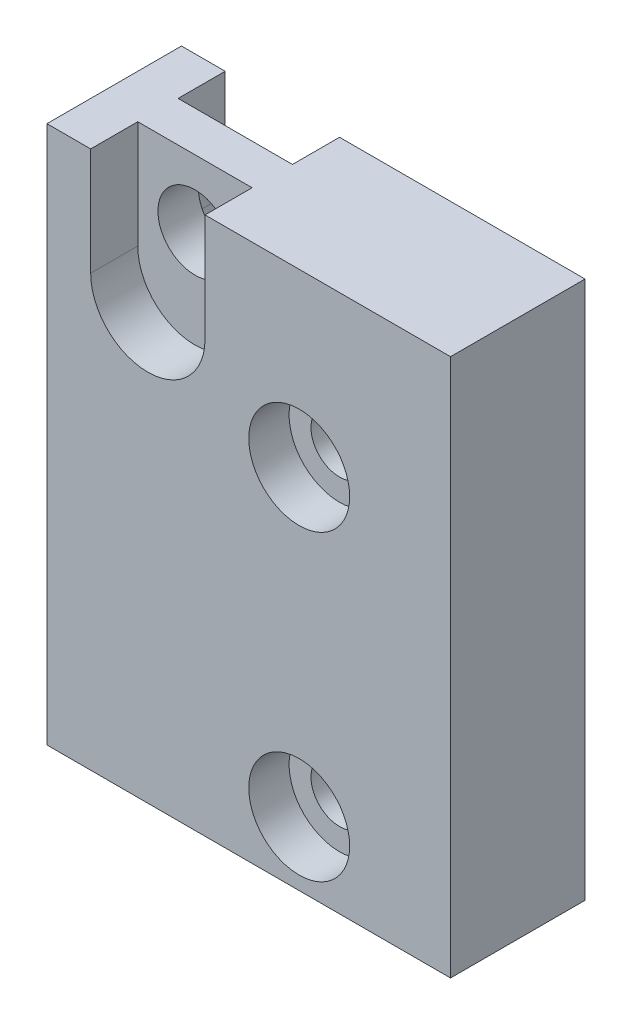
ISO-10303-21;
HEADER;
FILE_DESCRIPTION(('STEP AP214'),'2;1');
FILE_NAME('part.step','',(''),(''),'','','');
FILE_SCHEMA(('AUTOMOTIVE_DESIGN { 1 0 10303 214 1 1 1 1 }'));
ENDSEC;
DATA;
#1=APPLICATION_CONTEXT('core data for automotive mechanical design processes');
#2=APPLICATION_PROTOCOL_DEFINITION('international standard','automotive_design',2000,#1);
#3=PRODUCT_CONTEXT('',#1,'mechanical');
#4=PRODUCT('Part','Part','',(#3));
#5=PRODUCT_RELATED_PRODUCT_CATEGORY('part','',(#4));
#6=PRODUCT_DEFINITION_FORMATION('','',#4);
#7=PRODUCT_DEFINITION_CONTEXT('part definition',#1,'design');
#8=PRODUCT_DEFINITION('design','',#6,#7);
#9=PRODUCT_DEFINITION_SHAPE('','',#8);
#10=(LENGTH_UNIT() NAMED_UNIT(*) SI_UNIT(.MILLI.,.METRE.));
#11=(NAMED_UNIT(*) PLANE_ANGLE_UNIT() SI_UNIT($,.RADIAN.));
#12=(NAMED_UNIT(*) SI_UNIT($,.STERADIAN.) SOLID_ANGLE_UNIT());
#13=UNCERTAINTY_MEASURE_WITH_UNIT(LENGTH_MEASURE(1.E-05),#10,'distance_accuracy_value','');
#14=(GEOMETRIC_REPRESENTATION_CONTEXT(3) GLOBAL_UNCERTAINTY_ASSIGNED_CONTEXT((#13)) GLOBAL_UNIT_ASSIGNED_CONTEXT((#10,
#11,#12)) REPRESENTATION_CONTEXT('',''));
#15=CARTESIAN_POINT('',(0.,0.,0.));
#16=DIRECTION('',(0.,0.,1.));
#17=DIRECTION('',(1.,0.,0.));
#18=AXIS2_PLACEMENT_3D('',#15,#16,#17);
#19=CARTESIAN_POINT('',(0.,0.,-10.));
#20=DIRECTION('',(0.,0.,1.));
#21=DIRECTION('',(1.,0.,0.));
#22=AXIS2_PLACEMENT_3D('',#19,#20,#21);
#23=PLANE('',#22);
#24=CARTESIAN_POINT('',(7.5,14.5,-10.));
#25=DIRECTION('',(0.,0.,1.));
#26=DIRECTION('',(1.,0.,0.));
#27=AXIS2_PLACEMENT_3D('',#24,#25,#26);
#28=CIRCLE('',#27,7.5);
#29=CARTESIAN_POINT('',(0.,14.5,-10.));
#30=VERTEX_POINT('',#29);
#31=EDGE_CURVE('E158',#30,#30,#28,.T.);
#32=ORIENTED_EDGE('',*,*,#31,.T.);
#33=EDGE_LOOP('',(#32));
#34=FACE_BOUND('',#33,.T.);
#35=CARTESIAN_POINT('',(7.5,-30.5,-10.));
#36=DIRECTION('',(0.,0.,1.));
#37=DIRECTION('',(1.,0.,0.));
#38=AXIS2_PLACEMENT_3D('',#35,#36,#37);
#39=CIRCLE('',#38,7.5);
#40=CARTESIAN_POINT('',(0.,-30.5,-10.));
#41=VERTEX_POINT('',#40);
#42=EDGE_CURVE('E161',#41,#41,#39,.T.);
#43=ORIENTED_EDGE('',*,*,#42,.T.);
#44=EDGE_LOOP('',(#43));
#45=FACE_BOUND('',#44,.T.);
#46=DIRECTION('',(0.,-1.,0.));
#47=VECTOR('',#46,1.);
#48=CARTESIAN_POINT('',(-23.5,0.,-10.));
#49=LINE('',#48,#47);
#50=CARTESIAN_POINT('',(-23.5,40.,-10.));
#51=VERTEX_POINT('',#50);
#52=CARTESIAN_POINT('',(-23.5,24.,-10.));
#53=VERTEX_POINT('',#52);
#54=EDGE_CURVE('E509',#51,#53,#49,.T.);
#55=ORIENTED_EDGE('',*,*,#54,.T.);
#56=CARTESIAN_POINT('',(-15.,24.,-10.));
#57=DIRECTION('',(0.,0.,1.));
#58=DIRECTION('',(1.,0.,0.));
#59=AXIS2_PLACEMENT_3D('',#56,#57,#58);
#60=CIRCLE('',#59,8.5);
#61=CARTESIAN_POINT('',(-6.5,24.,-10.));
#62=VERTEX_POINT('',#61);
#63=EDGE_CURVE('E501',#53,#62,#60,.T.);
#64=ORIENTED_EDGE('',*,*,#63,.T.);
#65=DIRECTION('',(0.,1.,0.));
#66=VECTOR('',#65,1.);
#67=CARTESIAN_POINT('',(-6.5,0.,-10.));
#68=LINE('',#67,#66);
#69=CARTESIAN_POINT('',(-6.50000000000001,40.,-10.));
#70=VERTEX_POINT('',#69);
#71=EDGE_CURVE('E505',#62,#70,#68,.T.);
#72=ORIENTED_EDGE('',*,*,#71,.T.);
#73=DIRECTION('',(1.,0.,0.));
#74=VECTOR('',#73,1.);
#75=CARTESIAN_POINT('',(0.,40.,-10.));
#76=LINE('',#75,#74);
#77=CARTESIAN_POINT('',(30.,40.,-10.));
#78=VERTEX_POINT('',#77);
#79=EDGE_CURVE('E146',#70,#78,#76,.T.);
#80=ORIENTED_EDGE('',*,*,#79,.T.);
#81=DIRECTION('',(0.,-1.,0.));
#82=VECTOR('',#81,1.);
#83=CARTESIAN_POINT('',(30.,0.,-10.));
#84=LINE('',#83,#82);
#85=CARTESIAN_POINT('',(30.,-40.,-10.));
#86=VERTEX_POINT('',#85);
#87=EDGE_CURVE('E238',#78,#86,#84,.T.);
#88=ORIENTED_EDGE('',*,*,#87,.T.);
#89=DIRECTION('',(-1.,0.,0.));
#90=VECTOR('',#89,1.);
#91=CARTESIAN_POINT('',(0.,-40.,-10.));
#92=LINE('',#91,#90);
#93=CARTESIAN_POINT('',(-30.,-40.,-10.));
#94=VERTEX_POINT('',#93);
#95=EDGE_CURVE('E236',#86,#94,#92,.T.);
#96=ORIENTED_EDGE('',*,*,#95,.T.);
#97=DIRECTION('',(0.,1.,0.));
#98=VECTOR('',#97,1.);
#99=CARTESIAN_POINT('',(-30.,0.,-10.));
#100=LINE('',#99,#98);
#101=CARTESIAN_POINT('',(-30.,40.,-10.));
#102=VERTEX_POINT('',#101);
#103=EDGE_CURVE('E233',#94,#102,#100,.T.);
#104=ORIENTED_EDGE('',*,*,#103,.T.);
#105=EDGE_CURVE('E240',#102,#51,#76,.T.);
#106=ORIENTED_EDGE('',*,*,#105,.T.);
#107=EDGE_LOOP('',(#55,#64,#72,#80,#88,#96,#104,#106));
#108=FACE_BOUND('',#107,.T.);
#109=ADVANCED_FACE('F37',(#34,#45,#108),#23,.F.);
#110=CARTESIAN_POINT('',(-15.,30.,-10.));
#111=DIRECTION('',(0.,0.,1.));
#112=DIRECTION('',(1.,0.,0.));
#113=AXIS2_PLACEMENT_3D('',#110,#111,#112);
#114=CYLINDRICAL_SURFACE('',#113,5.5);
#115=CARTESIAN_POINT('',(-15.,30.,3.));
#116=DIRECTION('',(0.,0.,1.));
#117=DIRECTION('',(1.,0.,0.));
#118=AXIS2_PLACEMENT_3D('',#115,#116,#117);
#119=CIRCLE('',#118,5.5);
#120=CARTESIAN_POINT('',(-9.50000000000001,30.,3.));
#121=VERTEX_POINT('',#120);
#122=EDGE_CURVE('E172',#121,#121,#119,.F.);
#123=ORIENTED_EDGE('',*,*,#122,.F.);
#124=EDGE_LOOP('',(#123));
#125=FACE_BOUND('',#124,.T.);
#126=CARTESIAN_POINT('',(-15.,30.,-3.));
#127=DIRECTION('',(0.,0.,1.));
#128=DIRECTION('',(1.,0.,0.));
#129=AXIS2_PLACEMENT_3D('',#126,#127,#128);
#130=CIRCLE('',#129,5.5);
#131=CARTESIAN_POINT('',(-9.50000000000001,30.,-3.));
#132=VERTEX_POINT('',#131);
#133=EDGE_CURVE('E499',#132,#132,#130,.F.);
#134=ORIENTED_EDGE('',*,*,#133,.T.);
#135=EDGE_LOOP('',(#134));
#136=FACE_BOUND('',#135,.T.);
#137=ADVANCED_FACE('F39',(#125,#136),#114,.F.);
#138=CARTESIAN_POINT('',(0.,40.,-10.));
#139=DIRECTION('',(0.,-1.,0.));
#140=DIRECTION('',(0.,0.,-1.));
#141=AXIS2_PLACEMENT_3D('',#138,#139,#140);
#142=PLANE('',#141);
#143=DIRECTION('',(0.,0.,-1.));
#144=VECTOR('',#143,1.);
#145=CARTESIAN_POINT('',(-23.5,40.,-3.));
#146=LINE('',#145,#144);
#147=CARTESIAN_POINT('',(-23.5,40.,-3.));
#148=VERTEX_POINT('',#147);
#149=EDGE_CURVE('E147',#148,#51,#146,.T.);
#150=ORIENTED_EDGE('',*,*,#149,.T.);
#151=ORIENTED_EDGE('',*,*,#105,.F.);
#152=DIRECTION('',(0.,0.,1.));
#153=VECTOR('',#152,1.);
#154=CARTESIAN_POINT('',(-30.,40.,-10.));
#155=LINE('',#154,#153);
#156=CARTESIAN_POINT('',(-30.,40.,10.));
#157=VERTEX_POINT('',#156);
#158=EDGE_CURVE('E11',#102,#157,#155,.T.);
#159=ORIENTED_EDGE('',*,*,#158,.T.);
#160=DIRECTION('',(1.,0.,0.));
#161=VECTOR('',#160,1.);
#162=CARTESIAN_POINT('',(0.,40.,10.));
#163=LINE('',#162,#161);
#164=CARTESIAN_POINT('',(-23.5,40.,10.));
#165=VERTEX_POINT('',#164);
#166=EDGE_CURVE('E230',#157,#165,#163,.T.);
#167=ORIENTED_EDGE('',*,*,#166,.T.);
#168=DIRECTION('',(0.,0.,1.));
#169=VECTOR('',#168,1.);
#170=CARTESIAN_POINT('',(-23.5,40.,3.));
#171=LINE('',#170,#169);
#172=CARTESIAN_POINT('',(-23.5,40.,3.));
#173=VERTEX_POINT('',#172);
#174=EDGE_CURVE('E194',#173,#165,#171,.T.);
#175=ORIENTED_EDGE('',*,*,#174,.F.);
#176=DIRECTION('',(-1.,0.,0.));
#177=VECTOR('',#176,1.);
#178=CARTESIAN_POINT('',(0.,40.,3.));
#179=LINE('',#178,#177);
#180=CARTESIAN_POINT('',(-6.50000000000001,40.,3.));
#181=VERTEX_POINT('',#180);
#182=EDGE_CURVE('E185',#181,#173,#179,.T.);
#183=ORIENTED_EDGE('',*,*,#182,.F.);
#184=DIRECTION('',(0.,0.,1.));
#185=VECTOR('',#184,1.);
#186=CARTESIAN_POINT('',(-6.50000000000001,40.,3.));
#187=LINE('',#186,#185);
#188=CARTESIAN_POINT('',(-6.50000000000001,40.,10.));
#189=VERTEX_POINT('',#188);
#190=EDGE_CURVE('E197',#181,#189,#187,.T.);
#191=ORIENTED_EDGE('',*,*,#190,.T.);
#192=CARTESIAN_POINT('',(30.,40.,10.));
#193=VERTEX_POINT('',#192);
#194=EDGE_CURVE('E229',#189,#193,#163,.T.);
#195=ORIENTED_EDGE('',*,*,#194,.T.);
#196=DIRECTION('',(0.,0.,1.));
#197=VECTOR('',#196,1.);
#198=CARTESIAN_POINT('',(30.,40.,-10.));
#199=LINE('',#198,#197);
#200=EDGE_CURVE('E46',#78,#193,#199,.T.);
#201=ORIENTED_EDGE('',*,*,#200,.F.);
#202=ORIENTED_EDGE('',*,*,#79,.F.);
#203=DIRECTION('',(0.,0.,-1.));
#204=VECTOR('',#203,1.);
#205=CARTESIAN_POINT('',(-6.50000000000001,40.,-3.));
#206=LINE('',#205,#204);
#207=CARTESIAN_POINT('',(-6.50000000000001,40.,-3.));
#208=VERTEX_POINT('',#207);
#209=EDGE_CURVE('E132',#208,#70,#206,.T.);
#210=ORIENTED_EDGE('',*,*,#209,.F.);
#211=DIRECTION('',(-1.,0.,0.));
#212=VECTOR('',#211,1.);
#213=CARTESIAN_POINT('',(0.,40.,-3.));
#214=LINE('',#213,#212);
#215=EDGE_CURVE('E136',#208,#148,#214,.T.);
#216=ORIENTED_EDGE('',*,*,#215,.T.);
#217=EDGE_LOOP('',(#150,#151,#159,#167,#175,#183,#191,#195,#201,#202,#210,#216));
#218=FACE_BOUND('',#217,.T.);
#219=ADVANCED_FACE('F144',(#218),#142,.F.);
#220=CARTESIAN_POINT('',(7.5,14.5,-10.));
#221=DIRECTION('',(0.,0.,1.));
#222=DIRECTION('',(1.,0.,0.));
#223=AXIS2_PLACEMENT_3D('',#220,#221,#222);
#224=CYLINDRICAL_SURFACE('',#223,4.25);
#225=CARTESIAN_POINT('',(7.5,14.5,4.));
#226=DIRECTION('',(0.,0.,1.));
#227=DIRECTION('',(1.,0.,0.));
#228=AXIS2_PLACEMENT_3D('',#225,#226,#227);
#229=CIRCLE('',#228,4.25);
#230=CARTESIAN_POINT('',(11.75,14.5,4.));
#231=VERTEX_POINT('',#230);
#232=EDGE_CURVE('E203',#231,#231,#229,.F.);
#233=ORIENTED_EDGE('',*,*,#232,.F.);
#234=EDGE_LOOP('',(#233));
#235=FACE_BOUND('',#234,.T.);
#236=CARTESIAN_POINT('',(7.5,14.5,-4.));
#237=DIRECTION('',(0.,0.,1.));
#238=DIRECTION('',(1.,0.,0.));
#239=AXIS2_PLACEMENT_3D('',#236,#237,#238);
#240=CIRCLE('',#239,4.25);
#241=CARTESIAN_POINT('',(11.75,14.5,-4.));
#242=VERTEX_POINT('',#241);
#243=EDGE_CURVE('E154',#242,#242,#240,.F.);
#244=ORIENTED_EDGE('',*,*,#243,.T.);
#245=EDGE_LOOP('',(#244));
#246=FACE_BOUND('',#245,.T.);
#247=ADVANCED_FACE('F284',(#235,#246),#224,.F.);
#248=CARTESIAN_POINT('',(7.5,-30.5,-10.));
#249=DIRECTION('',(0.,0.,1.));
#250=DIRECTION('',(1.,0.,0.));
#251=AXIS2_PLACEMENT_3D('',#248,#249,#250);
#252=CYLINDRICAL_SURFACE('',#251,4.25);
#253=CARTESIAN_POINT('',(7.5,-30.5,4.));
#254=DIRECTION('',(0.,0.,1.));
#255=DIRECTION('',(1.,0.,0.));
#256=AXIS2_PLACEMENT_3D('',#253,#254,#255);
#257=CIRCLE('',#256,4.25);
#258=CARTESIAN_POINT('',(11.75,-30.5,4.));
#259=VERTEX_POINT('',#258);
#260=EDGE_CURVE('E212',#259,#259,#257,.F.);
#261=ORIENTED_EDGE('',*,*,#260,.F.);
#262=EDGE_LOOP('',(#261));
#263=FACE_BOUND('',#262,.T.);
#264=CARTESIAN_POINT('',(7.5,-30.5,-4.));
#265=DIRECTION('',(0.,0.,1.));
#266=DIRECTION('',(1.,0.,0.));
#267=AXIS2_PLACEMENT_3D('',#264,#265,#266);
#268=CIRCLE('',#267,4.25);
#269=CARTESIAN_POINT('',(11.75,-30.5,-4.));
#270=VERTEX_POINT('',#269);
#271=EDGE_CURVE('E164',#270,#270,#268,.F.);
#272=ORIENTED_EDGE('',*,*,#271,.T.);
#273=EDGE_LOOP('',(#272));
#274=FACE_BOUND('',#273,.T.);
#275=ADVANCED_FACE('F288',(#263,#274),#252,.F.);
#276=CARTESIAN_POINT('',(-30.,0.,-10.));
#277=DIRECTION('',(1.,0.,0.));
#278=DIRECTION('',(0.,0.,-1.));
#279=AXIS2_PLACEMENT_3D('',#276,#277,#278);
#280=PLANE('',#279);
#281=DIRECTION('',(0.,0.,1.));
#282=VECTOR('',#281,1.);
#283=CARTESIAN_POINT('',(-30.,-40.,-10.));
#284=LINE('',#283,#282);
#285=CARTESIAN_POINT('',(-30.,-40.,10.));
#286=VERTEX_POINT('',#285);
#287=EDGE_CURVE('E41',#94,#286,#284,.T.);
#288=ORIENTED_EDGE('',*,*,#287,.T.);
#289=DIRECTION('',(0.,1.,0.));
#290=VECTOR('',#289,1.);
#291=CARTESIAN_POINT('',(-30.,0.,10.));
#292=LINE('',#291,#290);
#293=EDGE_CURVE('E218',#286,#157,#292,.T.);
#294=ORIENTED_EDGE('',*,*,#293,.T.);
#295=ORIENTED_EDGE('',*,*,#158,.F.);
#296=ORIENTED_EDGE('',*,*,#103,.F.);
#297=EDGE_LOOP('',(#288,#294,#295,#296));
#298=FACE_BOUND('',#297,.T.);
#299=ADVANCED_FACE('F253',(#298),#280,.F.);
#300=CARTESIAN_POINT('',(30.,0.,-10.));
#301=DIRECTION('',(-1.,0.,0.));
#302=DIRECTION('',(0.,0.,1.));
#303=AXIS2_PLACEMENT_3D('',#300,#301,#302);
#304=PLANE('',#303);
#305=ORIENTED_EDGE('',*,*,#200,.T.);
#306=DIRECTION('',(0.,-1.,0.));
#307=VECTOR('',#306,1.);
#308=CARTESIAN_POINT('',(30.,0.,10.));
#309=LINE('',#308,#307);
#310=CARTESIAN_POINT('',(30.,-40.,10.));
#311=VERTEX_POINT('',#310);
#312=EDGE_CURVE('E226',#193,#311,#309,.T.);
#313=ORIENTED_EDGE('',*,*,#312,.T.);
#314=DIRECTION('',(0.,0.,1.));
#315=VECTOR('',#314,1.);
#316=CARTESIAN_POINT('',(30.,-40.,-10.));
#317=LINE('',#316,#315);
#318=EDGE_CURVE('E244',#86,#311,#317,.T.);
#319=ORIENTED_EDGE('',*,*,#318,.F.);
#320=ORIENTED_EDGE('',*,*,#87,.F.);
#321=EDGE_LOOP('',(#305,#313,#319,#320));
#322=FACE_BOUND('',#321,.T.);
#323=ADVANCED_FACE('F262',(#322),#304,.F.);
#324=CARTESIAN_POINT('',(0.,-40.,-10.));
#325=DIRECTION('',(0.,1.,0.));
#326=DIRECTION('',(0.,0.,1.));
#327=AXIS2_PLACEMENT_3D('',#324,#325,#326);
#328=PLANE('',#327);
#329=ORIENTED_EDGE('',*,*,#318,.T.);
#330=DIRECTION('',(-1.,0.,0.));
#331=VECTOR('',#330,1.);
#332=CARTESIAN_POINT('',(0.,-40.,10.));
#333=LINE('',#332,#331);
#334=EDGE_CURVE('E223',#311,#286,#333,.T.);
#335=ORIENTED_EDGE('',*,*,#334,.T.);
#336=ORIENTED_EDGE('',*,*,#287,.F.);
#337=ORIENTED_EDGE('',*,*,#95,.F.);
#338=EDGE_LOOP('',(#329,#335,#336,#337));
#339=FACE_BOUND('',#338,.T.);
#340=ADVANCED_FACE('F260',(#339),#328,.F.);
#341=CARTESIAN_POINT('',(0.,0.,10.));
#342=DIRECTION('',(0.,0.,1.));
#343=DIRECTION('',(1.,0.,0.));
#344=AXIS2_PLACEMENT_3D('',#341,#342,#343);
#345=PLANE('',#344);
#346=DIRECTION('',(0.,-1.,0.));
#347=VECTOR('',#346,1.);
#348=CARTESIAN_POINT('',(-23.5,0.,10.));
#349=LINE('',#348,#347);
#350=CARTESIAN_POINT('',(-23.5,24.,10.));
#351=VERTEX_POINT('',#350);
#352=EDGE_CURVE('E62',#165,#351,#349,.T.);
#353=ORIENTED_EDGE('',*,*,#352,.F.);
#354=ORIENTED_EDGE('',*,*,#166,.F.);
#355=ORIENTED_EDGE('',*,*,#293,.F.);
#356=ORIENTED_EDGE('',*,*,#334,.F.);
#357=ORIENTED_EDGE('',*,*,#312,.F.);
#358=ORIENTED_EDGE('',*,*,#194,.F.);
#359=DIRECTION('',(0.,1.,0.));
#360=VECTOR('',#359,1.);
#361=CARTESIAN_POINT('',(-6.5,0.,10.));
#362=LINE('',#361,#360);
#363=CARTESIAN_POINT('',(-6.5,24.,10.));
#364=VERTEX_POINT('',#363);
#365=EDGE_CURVE('E176',#364,#189,#362,.T.);
#366=ORIENTED_EDGE('',*,*,#365,.F.);
#367=CARTESIAN_POINT('',(-15.,24.,10.));
#368=DIRECTION('',(0.,0.,1.));
#369=DIRECTION('',(1.,0.,0.));
#370=AXIS2_PLACEMENT_3D('',#367,#368,#369);
#371=CIRCLE('',#370,8.5);
#372=EDGE_CURVE('E190',#351,#364,#371,.T.);
#373=ORIENTED_EDGE('',*,*,#372,.F.);
#374=EDGE_LOOP('',(#353,#354,#355,#356,#357,#358,#366,#373));
#375=FACE_BOUND('',#374,.T.);
#376=CARTESIAN_POINT('',(7.5,14.5,10.));
#377=DIRECTION('',(0.,0.,1.));
#378=DIRECTION('',(1.,0.,0.));
#379=AXIS2_PLACEMENT_3D('',#376,#377,#378);
#380=CIRCLE('',#379,7.5);
#381=CARTESIAN_POINT('',(15.,14.5,10.));
#382=VERTEX_POINT('',#381);
#383=EDGE_CURVE('E196',#382,#382,#380,.T.);
#384=ORIENTED_EDGE('',*,*,#383,.F.);
#385=EDGE_LOOP('',(#384));
#386=FACE_BOUND('',#385,.T.);
#387=CARTESIAN_POINT('',(7.5,-30.5,10.));
#388=DIRECTION('',(0.,0.,1.));
#389=DIRECTION('',(1.,0.,0.));
#390=AXIS2_PLACEMENT_3D('',#387,#388,#389);
#391=CIRCLE('',#390,7.5);
#392=CARTESIAN_POINT('',(15.,-30.5,10.));
#393=VERTEX_POINT('',#392);
#394=EDGE_CURVE('E209',#393,#393,#391,.T.);
#395=ORIENTED_EDGE('',*,*,#394,.F.);
#396=EDGE_LOOP('',(#395));
#397=FACE_BOUND('',#396,.T.);
#398=ADVANCED_FACE('F257',(#375,#386,#397),#345,.T.);
#399=CARTESIAN_POINT('',(7.5,-30.5,4.));
#400=DIRECTION('',(0.,0.,1.));
#401=DIRECTION('',(1.,0.,0.));
#402=AXIS2_PLACEMENT_3D('',#399,#400,#401);
#403=CYLINDRICAL_SURFACE('',#402,7.5);
#404=CARTESIAN_POINT('',(7.5,-30.5,4.));
#405=DIRECTION('',(0.,0.,1.));
#406=DIRECTION('',(1.,0.,0.));
#407=AXIS2_PLACEMENT_3D('',#404,#405,#406);
#408=CIRCLE('',#407,7.5);
#409=CARTESIAN_POINT('',(15.,-30.5,4.));
#410=VERTEX_POINT('',#409);
#411=EDGE_CURVE('E215',#410,#410,#408,.T.);
#412=CARTESIAN_POINT('',(15.,-30.5,4.));
#413=CARTESIAN_POINT('',(15.,-30.5,4.0625));
#414=CARTESIAN_POINT('',(15.,-30.5,4.125));
#415=CARTESIAN_POINT('',(15.,-30.5,4.25));
#416=CARTESIAN_POINT('',(15.,-30.5,4.3125));
#417=CARTESIAN_POINT('',(15.,-30.5,4.4375));
#418=CARTESIAN_POINT('',(15.,-30.5,4.5));
#419=CARTESIAN_POINT('',(15.,-30.5,4.625));
#420=CARTESIAN_POINT('',(15.,-30.5,4.6875));
#421=CARTESIAN_POINT('',(15.,-30.5,4.8125));
#422=CARTESIAN_POINT('',(15.,-30.5,4.875));
#423=CARTESIAN_POINT('',(15.,-30.5,5.));
#424=CARTESIAN_POINT('',(15.,-30.5,5.0625));
#425=CARTESIAN_POINT('',(15.,-30.5,5.1875));
#426=CARTESIAN_POINT('',(15.,-30.5,5.25));
#427=CARTESIAN_POINT('',(15.,-30.5,5.375));
#428=CARTESIAN_POINT('',(15.,-30.5,5.4375));
#429=CARTESIAN_POINT('',(15.,-30.5,5.5625));
#430=CARTESIAN_POINT('',(15.,-30.5,5.625));
#431=CARTESIAN_POINT('',(15.,-30.5,5.75));
#432=CARTESIAN_POINT('',(15.,-30.5,5.8125));
#433=CARTESIAN_POINT('',(15.,-30.5,5.9375));
#434=CARTESIAN_POINT('',(15.,-30.5,6.));
#435=CARTESIAN_POINT('',(15.,-30.5,6.125));
#436=CARTESIAN_POINT('',(15.,-30.5,6.1875));
#437=CARTESIAN_POINT('',(15.,-30.5,6.3125));
#438=CARTESIAN_POINT('',(15.,-30.5,6.375));
#439=CARTESIAN_POINT('',(15.,-30.5,6.5));
#440=CARTESIAN_POINT('',(15.,-30.5,6.5625));
#441=CARTESIAN_POINT('',(15.,-30.5,6.6875));
#442=CARTESIAN_POINT('',(15.,-30.5,6.75));
#443=CARTESIAN_POINT('',(15.,-30.5,6.875));
#444=CARTESIAN_POINT('',(15.,-30.5,6.9375));
#445=CARTESIAN_POINT('',(15.,-30.5,7.0625));
#446=CARTESIAN_POINT('',(15.,-30.5,7.125));
#447=CARTESIAN_POINT('',(15.,-30.5,7.25));
#448=CARTESIAN_POINT('',(15.,-30.5,7.3125));
#449=CARTESIAN_POINT('',(15.,-30.5,7.4375));
#450=CARTESIAN_POINT('',(15.,-30.5,7.5));
#451=CARTESIAN_POINT('',(15.,-30.5,7.625));
#452=CARTESIAN_POINT('',(15.,-30.5,7.6875));
#453=CARTESIAN_POINT('',(15.,-30.5,7.8125));
#454=CARTESIAN_POINT('',(15.,-30.5,7.875));
#455=CARTESIAN_POINT('',(15.,-30.5,8.));
#456=CARTESIAN_POINT('',(15.,-30.5,8.0625));
#457=CARTESIAN_POINT('',(15.,-30.5,8.1875));
#458=CARTESIAN_POINT('',(15.,-30.5,8.25));
#459=CARTESIAN_POINT('',(15.,-30.5,8.375));
#460=CARTESIAN_POINT('',(15.,-30.5,8.4375));
#461=CARTESIAN_POINT('',(15.,-30.5,8.5625));
#462=CARTESIAN_POINT('',(15.,-30.5,8.625));
#463=CARTESIAN_POINT('',(15.,-30.5,8.75));
#464=CARTESIAN_POINT('',(15.,-30.5,8.8125));
#465=CARTESIAN_POINT('',(15.,-30.5,8.9375));
#466=CARTESIAN_POINT('',(15.,-30.5,9.));
#467=CARTESIAN_POINT('',(15.,-30.5,9.125));
#468=CARTESIAN_POINT('',(15.,-30.5,9.1875));
#469=CARTESIAN_POINT('',(15.,-30.5,9.3125));
#470=CARTESIAN_POINT('',(15.,-30.5,9.375));
#471=CARTESIAN_POINT('',(15.,-30.5,9.5));
#472=CARTESIAN_POINT('',(15.,-30.5,9.5625));
#473=CARTESIAN_POINT('',(15.,-30.5,9.6875));
#474=CARTESIAN_POINT('',(15.,-30.5,9.75));
#475=CARTESIAN_POINT('',(15.,-30.5,9.875));
#476=CARTESIAN_POINT('',(15.,-30.5,9.9375));
#477=CARTESIAN_POINT('',(15.,-30.5,10.));
#478=B_SPLINE_CURVE_WITH_KNOTS('',3,(#412,#413,#414,#415,#416,#417,#418,#419,#420,#421,#422,
#423,#424,#425,#426,#427,#428,#429,#430,#431,#432,#433,#434,#435,#436,#437,#438,#439,#440,#441,
#442,#443,#444,#445,#446,#447,#448,#449,#450,#451,#452,#453,#454,#455,#456,#457,#458,#459,#460,
#461,#462,#463,#464,#465,#466,#467,#468,#469,#470,#471,#472,#473,#474,#475,#476,#477),
.UNSPECIFIED.,.F.,.F.,(4,2,2,2,2,2,2,2,2,2,2,2,2,2,2,2,2,2,2,2,2,2,2,2,2,2,2,2,2,2,2,2,4),(0.,
0.1875,0.375,0.5625,0.750000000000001,0.937500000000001,1.125,1.3125,1.5,1.6875,1.875,2.0625,
2.25,2.4375,2.625,2.8125,3.,3.1875,3.375,3.5625,3.75,3.9375,4.125,4.3125,4.5,4.6875,4.875,
5.0625,5.25,5.4375,5.625,5.8125,6.),.UNSPECIFIED.);
#479=EDGE_CURVE('BSEAM268',#410,#393,#478,.T.);
#480=ORIENTED_EDGE('',*,*,#411,.F.);
#481=ORIENTED_EDGE('',*,*,#394,.T.);
#482=ORIENTED_EDGE('',*,*,#479,.T.);
#483=ORIENTED_EDGE('',*,*,#479,.F.);
#484=EDGE_LOOP('',(#480,#482,#481,#483));
#485=FACE_BOUND('',#484,.T.);
#486=ADVANCED_FACE('F268',(#485),#403,.F.);
#487=CARTESIAN_POINT('',(0.,0.,4.));
#488=DIRECTION('',(0.,0.,1.));
#489=DIRECTION('',(1.,0.,0.));
#490=AXIS2_PLACEMENT_3D('',#487,#488,#489);
#491=PLANE('',#490);
#492=ORIENTED_EDGE('',*,*,#260,.T.);
#493=EDGE_LOOP('',(#492));
#494=FACE_BOUND('',#493,.T.);
#495=ORIENTED_EDGE('',*,*,#411,.T.);
#496=EDGE_LOOP('',(#495));
#497=FACE_BOUND('',#496,.T.);
#498=ADVANCED_FACE('F320',(#494,#497),#491,.T.);
#499=CARTESIAN_POINT('',(7.5,14.5,4.));
#500=DIRECTION('',(0.,0.,1.));
#501=DIRECTION('',(1.,0.,0.));
#502=AXIS2_PLACEMENT_3D('',#499,#500,#501);
#503=CYLINDRICAL_SURFACE('',#502,7.5);
#504=CARTESIAN_POINT('',(7.5,14.5,4.));
#505=DIRECTION('',(0.,0.,1.));
#506=DIRECTION('',(1.,0.,0.));
#507=AXIS2_PLACEMENT_3D('',#504,#505,#506);
#508=CIRCLE('',#507,7.5);
#509=CARTESIAN_POINT('',(15.,14.5,4.));
#510=VERTEX_POINT('',#509);
#511=EDGE_CURVE('E206',#510,#510,#508,.T.);
#512=CARTESIAN_POINT('',(15.,14.5,4.));
#513=CARTESIAN_POINT('',(15.,14.5,4.0625));
#514=CARTESIAN_POINT('',(15.,14.5,4.125));
#515=CARTESIAN_POINT('',(15.,14.5,4.25));
#516=CARTESIAN_POINT('',(15.,14.5,4.3125));
#517=CARTESIAN_POINT('',(15.,14.5,4.4375));
#518=CARTESIAN_POINT('',(15.,14.5,4.5));
#519=CARTESIAN_POINT('',(15.,14.5,4.625));
#520=CARTESIAN_POINT('',(15.,14.5,4.6875));
#521=CARTESIAN_POINT('',(15.,14.5,4.8125));
#522=CARTESIAN_POINT('',(15.,14.5,4.875));
#523=CARTESIAN_POINT('',(15.,14.5,5.));
#524=CARTESIAN_POINT('',(15.,14.5,5.0625));
#525=CARTESIAN_POINT('',(15.,14.5,5.1875));
#526=CARTESIAN_POINT('',(15.,14.5,5.25));
#527=CARTESIAN_POINT('',(15.,14.5,5.375));
#528=CARTESIAN_POINT('',(15.,14.5,5.4375));
#529=CARTESIAN_POINT('',(15.,14.5,5.5625));
#530=CARTESIAN_POINT('',(15.,14.5,5.625));
#531=CARTESIAN_POINT('',(15.,14.5,5.75));
#532=CARTESIAN_POINT('',(15.,14.5,5.8125));
#533=CARTESIAN_POINT('',(15.,14.5,5.9375));
#534=CARTESIAN_POINT('',(15.,14.5,6.));
#535=CARTESIAN_POINT('',(15.,14.5,6.125));
#536=CARTESIAN_POINT('',(15.,14.5,6.1875));
#537=CARTESIAN_POINT('',(15.,14.5,6.3125));
#538=CARTESIAN_POINT('',(15.,14.5,6.375));
#539=CARTESIAN_POINT('',(15.,14.5,6.5));
#540=CARTESIAN_POINT('',(15.,14.5,6.5625));
#541=CARTESIAN_POINT('',(15.,14.5,6.6875));
#542=CARTESIAN_POINT('',(15.,14.5,6.75));
#543=CARTESIAN_POINT('',(15.,14.5,6.875));
#544=CARTESIAN_POINT('',(15.,14.5,6.9375));
#545=CARTESIAN_POINT('',(15.,14.5,7.0625));
#546=CARTESIAN_POINT('',(15.,14.5,7.125));
#547=CARTESIAN_POINT('',(15.,14.5,7.25));
#548=CARTESIAN_POINT('',(15.,14.5,7.3125));
#549=CARTESIAN_POINT('',(15.,14.5,7.4375));
#550=CARTESIAN_POINT('',(15.,14.5,7.5));
#551=CARTESIAN_POINT('',(15.,14.5,7.625));
#552=CARTESIAN_POINT('',(15.,14.5,7.6875));
#553=CARTESIAN_POINT('',(15.,14.5,7.8125));
#554=CARTESIAN_POINT('',(15.,14.5,7.875));
#555=CARTESIAN_POINT('',(15.,14.5,8.));
#556=CARTESIAN_POINT('',(15.,14.5,8.0625));
#557=CARTESIAN_POINT('',(15.,14.5,8.1875));
#558=CARTESIAN_POINT('',(15.,14.5,8.25));
#559=CARTESIAN_POINT('',(15.,14.5,8.375));
#560=CARTESIAN_POINT('',(15.,14.5,8.4375));
#561=CARTESIAN_POINT('',(15.,14.5,8.5625));
#562=CARTESIAN_POINT('',(15.,14.5,8.625));
#563=CARTESIAN_POINT('',(15.,14.5,8.75));
#564=CARTESIAN_POINT('',(15.,14.5,8.8125));
#565=CARTESIAN_POINT('',(15.,14.5,8.9375));
#566=CARTESIAN_POINT('',(15.,14.5,9.));
#567=CARTESIAN_POINT('',(15.,14.5,9.125));
#568=CARTESIAN_POINT('',(15.,14.5,9.1875));
#569=CARTESIAN_POINT('',(15.,14.5,9.3125));
#570=CARTESIAN_POINT('',(15.,14.5,9.375));
#571=CARTESIAN_POINT('',(15.,14.5,9.5));
#572=CARTESIAN_POINT('',(15.,14.5,9.5625));
#573=CARTESIAN_POINT('',(15.,14.5,9.6875));
#574=CARTESIAN_POINT('',(15.,14.5,9.75));
#575=CARTESIAN_POINT('',(15.,14.5,9.875));
#576=CARTESIAN_POINT('',(15.,14.5,9.9375));
#577=CARTESIAN_POINT('',(15.,14.5,10.));
#578=B_SPLINE_CURVE_WITH_KNOTS('',3,(#512,#513,#514,#515,#516,#517,#518,#519,#520,#521,#522,
#523,#524,#525,#526,#527,#528,#529,#530,#531,#532,#533,#534,#535,#536,#537,#538,#539,#540,#541,
#542,#543,#544,#545,#546,#547,#548,#549,#550,#551,#552,#553,#554,#555,#556,#557,#558,#559,#560,
#561,#562,#563,#564,#565,#566,#567,#568,#569,#570,#571,#572,#573,#574,#575,#576,#577),
.UNSPECIFIED.,.F.,.F.,(4,2,2,2,2,2,2,2,2,2,2,2,2,2,2,2,2,2,2,2,2,2,2,2,2,2,2,2,2,2,2,2,4),(0.,
0.1875,0.375,0.5625,0.750000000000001,0.937500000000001,1.125,1.3125,1.5,1.6875,1.875,2.0625,
2.25,2.4375,2.625,2.8125,3.,3.1875,3.375,3.5625,3.75,3.9375,4.125,4.3125,4.5,4.6875,4.875,
5.0625,5.25,5.4375,5.625,5.8125,6.),.UNSPECIFIED.);
#579=EDGE_CURVE('BSEAM329',#510,#382,#578,.T.);
#580=ORIENTED_EDGE('',*,*,#511,.F.);
#581=ORIENTED_EDGE('',*,*,#383,.T.);
#582=ORIENTED_EDGE('',*,*,#579,.T.);
#583=ORIENTED_EDGE('',*,*,#579,.F.);
#584=EDGE_LOOP('',(#580,#582,#581,#583));
#585=FACE_BOUND('',#584,.T.);
#586=ADVANCED_FACE('F329',(#585),#503,.F.);
#587=CARTESIAN_POINT('',(0.,0.,4.));
#588=DIRECTION('',(0.,0.,1.));
#589=DIRECTION('',(1.,0.,0.));
#590=AXIS2_PLACEMENT_3D('',#587,#588,#589);
#591=PLANE('',#590);
#592=ORIENTED_EDGE('',*,*,#232,.T.);
#593=EDGE_LOOP('',(#592));
#594=FACE_BOUND('',#593,.T.);
#595=ORIENTED_EDGE('',*,*,#511,.T.);
#596=EDGE_LOOP('',(#595));
#597=FACE_BOUND('',#596,.T.);
#598=ADVANCED_FACE('F339',(#594,#597),#591,.T.);
#599=CARTESIAN_POINT('',(-23.5,0.,3.));
#600=DIRECTION('',(-1.,0.,0.));
#601=DIRECTION('',(0.,-1.,0.));
#602=AXIS2_PLACEMENT_3D('',#599,#600,#601);
#603=PLANE('',#602);
#604=ORIENTED_EDGE('',*,*,#352,.T.);
#605=DIRECTION('',(0.,0.,1.));
#606=VECTOR('',#605,1.);
#607=CARTESIAN_POINT('',(-23.5,24.,3.));
#608=LINE('',#607,#606);
#609=CARTESIAN_POINT('',(-23.5,24.,3.));
#610=VERTEX_POINT('',#609);
#611=EDGE_CURVE('E188',#610,#351,#608,.T.);
#612=ORIENTED_EDGE('',*,*,#611,.F.);
#613=DIRECTION('',(0.,-1.,0.));
#614=VECTOR('',#613,1.);
#615=CARTESIAN_POINT('',(-23.5,0.,3.));
#616=LINE('',#615,#614);
#617=EDGE_CURVE('E175',#173,#610,#616,.T.);
#618=ORIENTED_EDGE('',*,*,#617,.F.);
#619=ORIENTED_EDGE('',*,*,#174,.T.);
#620=EDGE_LOOP('',(#604,#612,#618,#619));
#621=FACE_BOUND('',#620,.T.);
#622=ADVANCED_FACE('F349',(#621),#603,.F.);
#623=CARTESIAN_POINT('',(-6.5,0.,3.));
#624=DIRECTION('',(1.,0.,0.));
#625=DIRECTION('',(0.,1.,0.));
#626=AXIS2_PLACEMENT_3D('',#623,#624,#625);
#627=PLANE('',#626);
#628=ORIENTED_EDGE('',*,*,#365,.T.);
#629=ORIENTED_EDGE('',*,*,#190,.F.);
#630=DIRECTION('',(0.,1.,0.));
#631=VECTOR('',#630,1.);
#632=CARTESIAN_POINT('',(-6.5,0.,3.));
#633=LINE('',#632,#631);
#634=CARTESIAN_POINT('',(-6.5,24.,3.));
#635=VERTEX_POINT('',#634);
#636=EDGE_CURVE('E182',#635,#181,#633,.T.);
#637=ORIENTED_EDGE('',*,*,#636,.F.);
#638=DIRECTION('',(0.,0.,1.));
#639=VECTOR('',#638,1.);
#640=CARTESIAN_POINT('',(-6.5,24.,3.));
#641=LINE('',#640,#639);
#642=EDGE_CURVE('E200',#635,#364,#641,.T.);
#643=ORIENTED_EDGE('',*,*,#642,.T.);
#644=EDGE_LOOP('',(#628,#629,#637,#643));
#645=FACE_BOUND('',#644,.T.);
#646=ADVANCED_FACE('F365',(#645),#627,.F.);
#647=CARTESIAN_POINT('',(-15.,24.,3.));
#648=DIRECTION('',(0.,0.,1.));
#649=DIRECTION('',(1.,0.,0.));
#650=AXIS2_PLACEMENT_3D('',#647,#648,#649);
#651=CYLINDRICAL_SURFACE('',#650,8.5);
#652=ORIENTED_EDGE('',*,*,#372,.T.);
#653=ORIENTED_EDGE('',*,*,#642,.F.);
#654=CARTESIAN_POINT('',(-15.,24.,3.));
#655=DIRECTION('',(0.,0.,1.));
#656=DIRECTION('',(1.,0.,0.));
#657=AXIS2_PLACEMENT_3D('',#654,#655,#656);
#658=CIRCLE('',#657,8.5);
#659=EDGE_CURVE('E179',#610,#635,#658,.T.);
#660=ORIENTED_EDGE('',*,*,#659,.F.);
#661=ORIENTED_EDGE('',*,*,#611,.T.);
#662=EDGE_LOOP('',(#652,#653,#660,#661));
#663=FACE_BOUND('',#662,.T.);
#664=ADVANCED_FACE('F374',(#663),#651,.F.);
#665=CARTESIAN_POINT('',(0.,0.,3.));
#666=DIRECTION('',(0.,0.,1.));
#667=DIRECTION('',(1.,0.,0.));
#668=AXIS2_PLACEMENT_3D('',#665,#666,#667);
#669=PLANE('',#668);
#670=ORIENTED_EDGE('',*,*,#122,.T.);
#671=EDGE_LOOP('',(#670));
#672=FACE_BOUND('',#671,.T.);
#673=ORIENTED_EDGE('',*,*,#617,.T.);
#674=ORIENTED_EDGE('',*,*,#659,.T.);
#675=ORIENTED_EDGE('',*,*,#636,.T.);
#676=ORIENTED_EDGE('',*,*,#182,.T.);
#677=EDGE_LOOP('',(#673,#674,#675,#676));
#678=FACE_BOUND('',#677,.T.);
#679=ADVANCED_FACE('F384',(#672,#678),#669,.T.);
#680=CARTESIAN_POINT('',(7.5,-30.5,-4.));
#681=DIRECTION('',(0.,0.,-1.));
#682=DIRECTION('',(-1.,0.,0.));
#683=AXIS2_PLACEMENT_3D('',#680,#681,#682);
#684=CYLINDRICAL_SURFACE('',#683,7.5);
#685=CARTESIAN_POINT('',(7.5,-30.5,-4.));
#686=DIRECTION('',(0.,0.,1.));
#687=DIRECTION('',(1.,0.,0.));
#688=AXIS2_PLACEMENT_3D('',#685,#686,#687);
#689=CIRCLE('',#688,7.5);
#690=CARTESIAN_POINT('',(0.,-30.5,-4.));
#691=VERTEX_POINT('',#690);
#692=EDGE_CURVE('E167',#691,#691,#689,.T.);
#693=CARTESIAN_POINT('',(0.,-30.5,-4.));
#694=CARTESIAN_POINT('',(0.,-30.5,-4.0625));
#695=CARTESIAN_POINT('',(0.,-30.5,-4.125));
#696=CARTESIAN_POINT('',(0.,-30.5,-4.25));
#697=CARTESIAN_POINT('',(0.,-30.5,-4.3125));
#698=CARTESIAN_POINT('',(0.,-30.5,-4.4375));
#699=CARTESIAN_POINT('',(0.,-30.5,-4.5));
#700=CARTESIAN_POINT('',(0.,-30.5,-4.625));
#701=CARTESIAN_POINT('',(0.,-30.5,-4.6875));
#702=CARTESIAN_POINT('',(0.,-30.5,-4.8125));
#703=CARTESIAN_POINT('',(0.,-30.5,-4.875));
#704=CARTESIAN_POINT('',(0.,-30.5,-5.));
#705=CARTESIAN_POINT('',(0.,-30.5,-5.0625));
#706=CARTESIAN_POINT('',(0.,-30.5,-5.1875));
#707=CARTESIAN_POINT('',(0.,-30.5,-5.25));
#708=CARTESIAN_POINT('',(0.,-30.5,-5.375));
#709=CARTESIAN_POINT('',(0.,-30.5,-5.4375));
#710=CARTESIAN_POINT('',(0.,-30.5,-5.5625));
#711=CARTESIAN_POINT('',(0.,-30.5,-5.625));
#712=CARTESIAN_POINT('',(0.,-30.5,-5.75));
#713=CARTESIAN_POINT('',(0.,-30.5,-5.8125));
#714=CARTESIAN_POINT('',(0.,-30.5,-5.9375));
#715=CARTESIAN_POINT('',(0.,-30.5,-6.));
#716=CARTESIAN_POINT('',(0.,-30.5,-6.125));
#717=CARTESIAN_POINT('',(0.,-30.5,-6.1875));
#718=CARTESIAN_POINT('',(0.,-30.5,-6.3125));
#719=CARTESIAN_POINT('',(0.,-30.5,-6.375));
#720=CARTESIAN_POINT('',(0.,-30.5,-6.5));
#721=CARTESIAN_POINT('',(0.,-30.5,-6.5625));
#722=CARTESIAN_POINT('',(0.,-30.5,-6.6875));
#723=CARTESIAN_POINT('',(0.,-30.5,-6.75));
#724=CARTESIAN_POINT('',(0.,-30.5,-6.875));
#725=CARTESIAN_POINT('',(0.,-30.5,-6.9375));
#726=CARTESIAN_POINT('',(0.,-30.5,-7.0625));
#727=CARTESIAN_POINT('',(0.,-30.5,-7.125));
#728=CARTESIAN_POINT('',(0.,-30.5,-7.25));
#729=CARTESIAN_POINT('',(0.,-30.5,-7.3125));
#730=CARTESIAN_POINT('',(0.,-30.5,-7.4375));
#731=CARTESIAN_POINT('',(0.,-30.5,-7.5));
#732=CARTESIAN_POINT('',(0.,-30.5,-7.625));
#733=CARTESIAN_POINT('',(0.,-30.5,-7.6875));
#734=CARTESIAN_POINT('',(0.,-30.5,-7.8125));
#735=CARTESIAN_POINT('',(0.,-30.5,-7.875));
#736=CARTESIAN_POINT('',(0.,-30.5,-8.));
#737=CARTESIAN_POINT('',(0.,-30.5,-8.0625));
#738=CARTESIAN_POINT('',(0.,-30.5,-8.1875));
#739=CARTESIAN_POINT('',(0.,-30.5,-8.25));
#740=CARTESIAN_POINT('',(0.,-30.5,-8.375));
#741=CARTESIAN_POINT('',(0.,-30.5,-8.4375));
#742=CARTESIAN_POINT('',(0.,-30.5,-8.5625));
#743=CARTESIAN_POINT('',(0.,-30.5,-8.625));
#744=CARTESIAN_POINT('',(0.,-30.5,-8.75));
#745=CARTESIAN_POINT('',(0.,-30.5,-8.8125));
#746=CARTESIAN_POINT('',(0.,-30.5,-8.9375));
#747=CARTESIAN_POINT('',(0.,-30.5,-9.));
#748=CARTESIAN_POINT('',(0.,-30.5,-9.125));
#749=CARTESIAN_POINT('',(0.,-30.5,-9.1875));
#750=CARTESIAN_POINT('',(0.,-30.5,-9.3125));
#751=CARTESIAN_POINT('',(0.,-30.5,-9.375));
#752=CARTESIAN_POINT('',(0.,-30.5,-9.5));
#753=CARTESIAN_POINT('',(0.,-30.5,-9.5625));
#754=CARTESIAN_POINT('',(0.,-30.5,-9.6875));
#755=CARTESIAN_POINT('',(0.,-30.5,-9.75));
#756=CARTESIAN_POINT('',(0.,-30.5,-9.875));
#757=CARTESIAN_POINT('',(0.,-30.5,-9.9375));
#758=CARTESIAN_POINT('',(0.,-30.5,-10.));
#759=B_SPLINE_CURVE_WITH_KNOTS('',3,(#693,#694,#695,#696,#697,#698,#699,#700,#701,#702,#703,
#704,#705,#706,#707,#708,#709,#710,#711,#712,#713,#714,#715,#716,#717,#718,#719,#720,#721,#722,
#723,#724,#725,#726,#727,#728,#729,#730,#731,#732,#733,#734,#735,#736,#737,#738,#739,#740,#741,
#742,#743,#744,#745,#746,#747,#748,#749,#750,#751,#752,#753,#754,#755,#756,#757,#758),
.UNSPECIFIED.,.F.,.F.,(4,2,2,2,2,2,2,2,2,2,2,2,2,2,2,2,2,2,2,2,2,2,2,2,2,2,2,2,2,2,2,2,4),(0.,
0.187499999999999,0.374999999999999,0.5625,0.75,0.9375,1.125,1.3125,1.5,1.6875,1.875,2.0625,
2.25,2.4375,2.625,2.8125,3.,3.1875,3.375,3.5625,3.75,3.9375,4.125,4.3125,4.5,4.6875,4.875,
5.0625,5.25,5.4375,5.625,5.8125,6.),.UNSPECIFIED.);
#760=EDGE_CURVE('BSEAM393',#691,#41,#759,.T.);
#761=ORIENTED_EDGE('',*,*,#692,.T.);
#762=ORIENTED_EDGE('',*,*,#42,.F.);
#763=ORIENTED_EDGE('',*,*,#760,.T.);
#764=ORIENTED_EDGE('',*,*,#760,.F.);
#765=EDGE_LOOP('',(#761,#763,#762,#764));
#766=FACE_BOUND('',#765,.T.);
#767=ADVANCED_FACE('F393',(#766),#684,.F.);
#768=CARTESIAN_POINT('',(0.,0.,-4.));
#769=DIRECTION('',(0.,0.,-1.));
#770=DIRECTION('',(1.,0.,0.));
#771=AXIS2_PLACEMENT_3D('',#768,#769,#770);
#772=PLANE('',#771);
#773=ORIENTED_EDGE('',*,*,#271,.F.);
#774=EDGE_LOOP('',(#773));
#775=FACE_BOUND('',#774,.T.);
#776=ORIENTED_EDGE('',*,*,#692,.F.);
#777=EDGE_LOOP('',(#776));
#778=FACE_BOUND('',#777,.T.);
#779=ADVANCED_FACE('F428',(#775,#778),#772,.T.);
#780=CARTESIAN_POINT('',(7.5,14.5,-4.));
#781=DIRECTION('',(0.,0.,-1.));
#782=DIRECTION('',(-1.,0.,0.));
#783=AXIS2_PLACEMENT_3D('',#780,#781,#782);
#784=CYLINDRICAL_SURFACE('',#783,7.5);
#785=CARTESIAN_POINT('',(7.5,14.5,-4.));
#786=DIRECTION('',(0.,0.,1.));
#787=DIRECTION('',(1.,0.,0.));
#788=AXIS2_PLACEMENT_3D('',#785,#786,#787);
#789=CIRCLE('',#788,7.5);
#790=CARTESIAN_POINT('',(0.,14.5,-4.));
#791=VERTEX_POINT('',#790);
#792=EDGE_CURVE('E157',#791,#791,#789,.T.);
#793=CARTESIAN_POINT('',(0.,14.5,-4.));
#794=CARTESIAN_POINT('',(0.,14.5,-4.0625));
#795=CARTESIAN_POINT('',(0.,14.5,-4.125));
#796=CARTESIAN_POINT('',(0.,14.5,-4.25));
#797=CARTESIAN_POINT('',(0.,14.5,-4.3125));
#798=CARTESIAN_POINT('',(0.,14.5,-4.4375));
#799=CARTESIAN_POINT('',(0.,14.5,-4.5));
#800=CARTESIAN_POINT('',(0.,14.5,-4.625));
#801=CARTESIAN_POINT('',(0.,14.5,-4.6875));
#802=CARTESIAN_POINT('',(0.,14.5,-4.8125));
#803=CARTESIAN_POINT('',(0.,14.5,-4.875));
#804=CARTESIAN_POINT('',(0.,14.5,-5.));
#805=CARTESIAN_POINT('',(0.,14.5,-5.0625));
#806=CARTESIAN_POINT('',(0.,14.5,-5.1875));
#807=CARTESIAN_POINT('',(0.,14.5,-5.25));
#808=CARTESIAN_POINT('',(0.,14.5,-5.375));
#809=CARTESIAN_POINT('',(0.,14.5,-5.4375));
#810=CARTESIAN_POINT('',(0.,14.5,-5.5625));
#811=CARTESIAN_POINT('',(0.,14.5,-5.625));
#812=CARTESIAN_POINT('',(0.,14.5,-5.75));
#813=CARTESIAN_POINT('',(0.,14.5,-5.8125));
#814=CARTESIAN_POINT('',(0.,14.5,-5.9375));
#815=CARTESIAN_POINT('',(0.,14.5,-6.));
#816=CARTESIAN_POINT('',(0.,14.5,-6.125));
#817=CARTESIAN_POINT('',(0.,14.5,-6.1875));
#818=CARTESIAN_POINT('',(0.,14.5,-6.3125));
#819=CARTESIAN_POINT('',(0.,14.5,-6.375));
#820=CARTESIAN_POINT('',(0.,14.5,-6.5));
#821=CARTESIAN_POINT('',(0.,14.5,-6.5625));
#822=CARTESIAN_POINT('',(0.,14.5,-6.6875));
#823=CARTESIAN_POINT('',(0.,14.5,-6.75));
#824=CARTESIAN_POINT('',(0.,14.5,-6.875));
#825=CARTESIAN_POINT('',(0.,14.5,-6.9375));
#826=CARTESIAN_POINT('',(0.,14.5,-7.0625));
#827=CARTESIAN_POINT('',(0.,14.5,-7.125));
#828=CARTESIAN_POINT('',(0.,14.5,-7.25));
#829=CARTESIAN_POINT('',(0.,14.5,-7.3125));
#830=CARTESIAN_POINT('',(0.,14.5,-7.4375));
#831=CARTESIAN_POINT('',(0.,14.5,-7.5));
#832=CARTESIAN_POINT('',(0.,14.5,-7.625));
#833=CARTESIAN_POINT('',(0.,14.5,-7.6875));
#834=CARTESIAN_POINT('',(0.,14.5,-7.8125));
#835=CARTESIAN_POINT('',(0.,14.5,-7.875));
#836=CARTESIAN_POINT('',(0.,14.5,-8.));
#837=CARTESIAN_POINT('',(0.,14.5,-8.0625));
#838=CARTESIAN_POINT('',(0.,14.5,-8.1875));
#839=CARTESIAN_POINT('',(0.,14.5,-8.25));
#840=CARTESIAN_POINT('',(0.,14.5,-8.375));
#841=CARTESIAN_POINT('',(0.,14.5,-8.4375));
#842=CARTESIAN_POINT('',(0.,14.5,-8.5625));
#843=CARTESIAN_POINT('',(0.,14.5,-8.625));
#844=CARTESIAN_POINT('',(0.,14.5,-8.75));
#845=CARTESIAN_POINT('',(0.,14.5,-8.8125));
#846=CARTESIAN_POINT('',(0.,14.5,-8.9375));
#847=CARTESIAN_POINT('',(0.,14.5,-9.));
#848=CARTESIAN_POINT('',(0.,14.5,-9.125));
#849=CARTESIAN_POINT('',(0.,14.5,-9.1875));
#850=CARTESIAN_POINT('',(0.,14.5,-9.3125));
#851=CARTESIAN_POINT('',(0.,14.5,-9.375));
#852=CARTESIAN_POINT('',(0.,14.5,-9.5));
#853=CARTESIAN_POINT('',(0.,14.5,-9.5625));
#854=CARTESIAN_POINT('',(0.,14.5,-9.6875));
#855=CARTESIAN_POINT('',(0.,14.5,-9.75));
#856=CARTESIAN_POINT('',(0.,14.5,-9.875));
#857=CARTESIAN_POINT('',(0.,14.5,-9.9375));
#858=CARTESIAN_POINT('',(0.,14.5,-10.));
#859=B_SPLINE_CURVE_WITH_KNOTS('',3,(#793,#794,#795,#796,#797,#798,#799,#800,#801,#802,#803,
#804,#805,#806,#807,#808,#809,#810,#811,#812,#813,#814,#815,#816,#817,#818,#819,#820,#821,#822,
#823,#824,#825,#826,#827,#828,#829,#830,#831,#832,#833,#834,#835,#836,#837,#838,#839,#840,#841,
#842,#843,#844,#845,#846,#847,#848,#849,#850,#851,#852,#853,#854,#855,#856,#857,#858),
.UNSPECIFIED.,.F.,.F.,(4,2,2,2,2,2,2,2,2,2,2,2,2,2,2,2,2,2,2,2,2,2,2,2,2,2,2,2,2,2,2,2,4),(0.,
0.187499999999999,0.374999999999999,0.5625,0.75,0.9375,1.125,1.3125,1.5,1.6875,1.875,2.0625,
2.25,2.4375,2.625,2.8125,3.,3.1875,3.375,3.5625,3.75,3.9375,4.125,4.3125,4.5,4.6875,4.875,
5.0625,5.25,5.4375,5.625,5.8125,6.),.UNSPECIFIED.);
#860=EDGE_CURVE('BSEAM438',#791,#30,#859,.T.);
#861=ORIENTED_EDGE('',*,*,#792,.T.);
#862=ORIENTED_EDGE('',*,*,#31,.F.);
#863=ORIENTED_EDGE('',*,*,#860,.T.);
#864=ORIENTED_EDGE('',*,*,#860,.F.);
#865=EDGE_LOOP('',(#861,#863,#862,#864));
#866=FACE_BOUND('',#865,.T.);
#867=ADVANCED_FACE('F438',(#866),#784,.F.);
#868=CARTESIAN_POINT('',(0.,0.,-4.));
#869=DIRECTION('',(0.,0.,-1.));
#870=DIRECTION('',(1.,0.,0.));
#871=AXIS2_PLACEMENT_3D('',#868,#869,#870);
#872=PLANE('',#871);
#873=ORIENTED_EDGE('',*,*,#243,.F.);
#874=EDGE_LOOP('',(#873));
#875=FACE_BOUND('',#874,.T.);
#876=ORIENTED_EDGE('',*,*,#792,.F.);
#877=EDGE_LOOP('',(#876));
#878=FACE_BOUND('',#877,.T.);
#879=ADVANCED_FACE('F448',(#875,#878),#872,.T.);
#880=CARTESIAN_POINT('',(-23.5,0.,-3.));
#881=DIRECTION('',(1.,0.,0.));
#882=DIRECTION('',(0.,1.,0.));
#883=AXIS2_PLACEMENT_3D('',#880,#881,#882);
#884=PLANE('',#883);
#885=ORIENTED_EDGE('',*,*,#54,.F.);
#886=ORIENTED_EDGE('',*,*,#149,.F.);
#887=DIRECTION('',(0.,-1.,0.));
#888=VECTOR('',#887,1.);
#889=CARTESIAN_POINT('',(-23.5,0.,-3.));
#890=LINE('',#889,#888);
#891=CARTESIAN_POINT('',(-23.5,24.,-3.));
#892=VERTEX_POINT('',#891);
#893=EDGE_CURVE('E54',#148,#892,#890,.T.);
#894=ORIENTED_EDGE('',*,*,#893,.T.);
#895=DIRECTION('',(0.,0.,-1.));
#896=VECTOR('',#895,1.);
#897=CARTESIAN_POINT('',(-23.5,24.,-3.));
#898=LINE('',#897,#896);
#899=EDGE_CURVE('E149',#892,#53,#898,.T.);
#900=ORIENTED_EDGE('',*,*,#899,.T.);
#901=EDGE_LOOP('',(#885,#886,#894,#900));
#902=FACE_BOUND('',#901,.T.);
#903=ADVANCED_FACE('F457',(#902),#884,.T.);
#904=CARTESIAN_POINT('',(-15.,24.,-3.));
#905=DIRECTION('',(0.,0.,-1.));
#906=DIRECTION('',(-1.,0.,0.));
#907=AXIS2_PLACEMENT_3D('',#904,#905,#906);
#908=CYLINDRICAL_SURFACE('',#907,8.5);
#909=ORIENTED_EDGE('',*,*,#63,.F.);
#910=ORIENTED_EDGE('',*,*,#899,.F.);
#911=CARTESIAN_POINT('',(-15.,24.,-3.));
#912=DIRECTION('',(0.,0.,1.));
#913=DIRECTION('',(1.,0.,0.));
#914=AXIS2_PLACEMENT_3D('',#911,#912,#913);
#915=CIRCLE('',#914,8.5);
#916=CARTESIAN_POINT('',(-6.5,24.,-3.));
#917=VERTEX_POINT('',#916);
#918=EDGE_CURVE('E135',#892,#917,#915,.T.);
#919=ORIENTED_EDGE('',*,*,#918,.T.);
#920=DIRECTION('',(0.,0.,-1.));
#921=VECTOR('',#920,1.);
#922=CARTESIAN_POINT('',(-6.5,24.,-3.));
#923=LINE('',#922,#921);
#924=EDGE_CURVE('E134',#917,#62,#923,.T.);
#925=ORIENTED_EDGE('',*,*,#924,.T.);
#926=EDGE_LOOP('',(#909,#910,#919,#925));
#927=FACE_BOUND('',#926,.T.);
#928=ADVANCED_FACE('F466',(#927),#908,.F.);
#929=CARTESIAN_POINT('',(-6.5,0.,-3.));
#930=DIRECTION('',(-1.,0.,0.));
#931=DIRECTION('',(0.,-1.,0.));
#932=AXIS2_PLACEMENT_3D('',#929,#930,#931);
#933=PLANE('',#932);
#934=ORIENTED_EDGE('',*,*,#71,.F.);
#935=ORIENTED_EDGE('',*,*,#924,.F.);
#936=DIRECTION('',(0.,1.,0.));
#937=VECTOR('',#936,1.);
#938=CARTESIAN_POINT('',(-6.5,0.,-3.));
#939=LINE('',#938,#937);
#940=EDGE_CURVE('E128',#917,#208,#939,.T.);
#941=ORIENTED_EDGE('',*,*,#940,.T.);
#942=ORIENTED_EDGE('',*,*,#209,.T.);
#943=EDGE_LOOP('',(#934,#935,#941,#942));
#944=FACE_BOUND('',#943,.T.);
#945=ADVANCED_FACE('F130',(#944),#933,.T.);
#946=CARTESIAN_POINT('',(0.,0.,-3.));
#947=DIRECTION('',(0.,0.,-1.));
#948=DIRECTION('',(1.,0.,0.));
#949=AXIS2_PLACEMENT_3D('',#946,#947,#948);
#950=PLANE('',#949);
#951=ORIENTED_EDGE('',*,*,#133,.F.);
#952=EDGE_LOOP('',(#951));
#953=FACE_BOUND('',#952,.T.);
#954=ORIENTED_EDGE('',*,*,#893,.F.);
#955=ORIENTED_EDGE('',*,*,#215,.F.);
#956=ORIENTED_EDGE('',*,*,#940,.F.);
#957=ORIENTED_EDGE('',*,*,#918,.F.);
#958=EDGE_LOOP('',(#954,#955,#956,#957));
#959=FACE_BOUND('',#958,.T.);
#960=ADVANCED_FACE('F139',(#953,#959),#950,.T.);
#961=CLOSED_SHELL('',(#109,#137,#219,#247,#275,#299,#323,#340,#398,#486,#498,#586,#598,#622,
#646,#664,#679,#767,#779,#867,#879,#903,#928,#945,#960));
#962=MANIFOLD_SOLID_BREP('B2',#961);
#963=ADVANCED_BREP_SHAPE_REPRESENTATION('',(#18,#962),#14);
#964=SHAPE_DEFINITION_REPRESENTATION(#9,#963);
ENDSEC;
END-ISO-10303-21;
